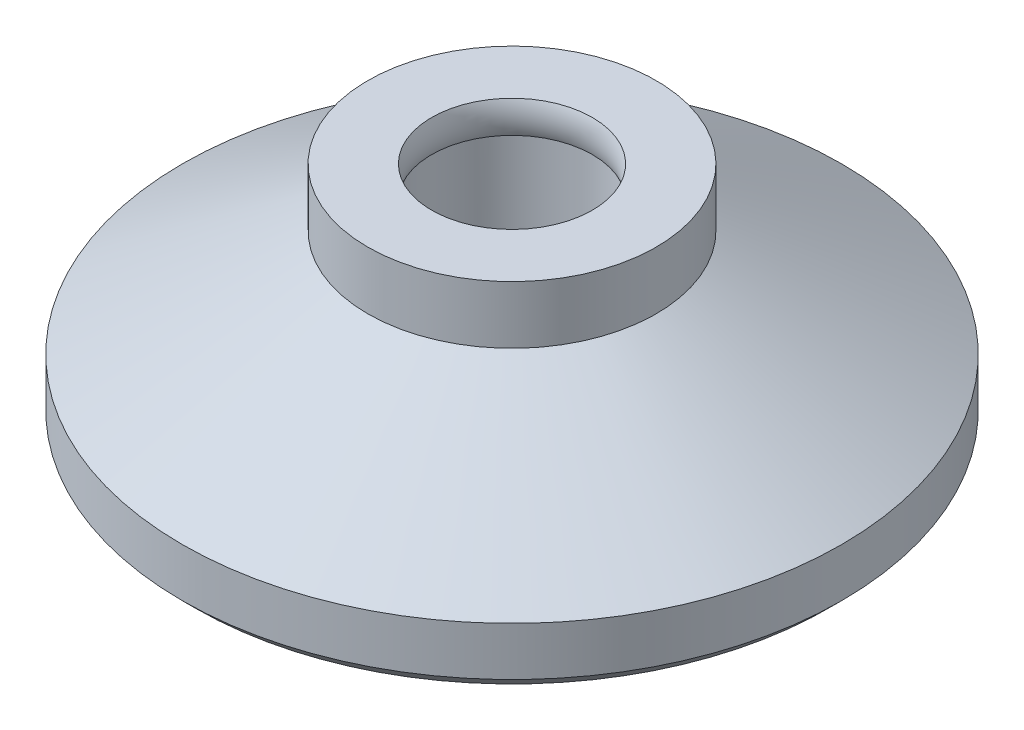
ISO-10303-21;
HEADER;
FILE_DESCRIPTION(('STEP AP214'),'2;1');
FILE_NAME('part.step','',(''),(''),'','','');
FILE_SCHEMA(('AUTOMOTIVE_DESIGN { 1 0 10303 214 1 1 1 1 }'));
ENDSEC;
DATA;
#1=APPLICATION_CONTEXT('core data for automotive mechanical design processes');
#2=APPLICATION_PROTOCOL_DEFINITION('international standard','automotive_design',2000,#1);
#3=PRODUCT_CONTEXT('',#1,'mechanical');
#4=PRODUCT('Part','Part','',(#3));
#5=PRODUCT_RELATED_PRODUCT_CATEGORY('part','',(#4));
#6=PRODUCT_DEFINITION_FORMATION('','',#4);
#7=PRODUCT_DEFINITION_CONTEXT('part definition',#1,'design');
#8=PRODUCT_DEFINITION('design','',#6,#7);
#9=PRODUCT_DEFINITION_SHAPE('','',#8);
#10=(LENGTH_UNIT() NAMED_UNIT(*) SI_UNIT(.MILLI.,.METRE.));
#11=(NAMED_UNIT(*) PLANE_ANGLE_UNIT() SI_UNIT($,.RADIAN.));
#12=(NAMED_UNIT(*) SI_UNIT($,.STERADIAN.) SOLID_ANGLE_UNIT());
#13=UNCERTAINTY_MEASURE_WITH_UNIT(LENGTH_MEASURE(1.E-05),#10,'distance_accuracy_value','');
#14=(GEOMETRIC_REPRESENTATION_CONTEXT(3) GLOBAL_UNCERTAINTY_ASSIGNED_CONTEXT((#13)) GLOBAL_UNIT_ASSIGNED_CONTEXT((#10,
#11,#12)) REPRESENTATION_CONTEXT('',''));
#15=CARTESIAN_POINT('',(0.,0.,0.));
#16=DIRECTION('',(0.,0.,1.));
#17=DIRECTION('',(1.,0.,0.));
#18=AXIS2_PLACEMENT_3D('',#15,#16,#17);
#19=CARTESIAN_POINT('',(0.,5.5,0.));
#20=DIRECTION('',(0.,-1.,0.));
#21=DIRECTION('',(0.,0.,-1.));
#22=AXIS2_PLACEMENT_3D('',#19,#20,#21);
#23=CYLINDRICAL_SURFACE('',#22,7.);
#24=CARTESIAN_POINT('',(0.,2.69615242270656,0.));
#25=DIRECTION('',(0.,1.,0.));
#26=DIRECTION('',(0.,0.,1.));
#27=AXIS2_PLACEMENT_3D('',#24,#25,#26);
#28=CIRCLE('',#27,7.);
#29=CARTESIAN_POINT('',(0.,2.69615242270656,7.));
#30=VERTEX_POINT('',#29);
#31=EDGE_CURVE('E91',#30,#30,#28,.T.);
#32=ORIENTED_EDGE('',*,*,#31,.T.);
#33=EDGE_LOOP('',(#32));
#34=FACE_BOUND('',#33,.T.);
#35=CARTESIAN_POINT('',(0.,5.5,0.));
#36=DIRECTION('',(0.,1.,0.));
#37=DIRECTION('',(0.,0.,1.));
#38=AXIS2_PLACEMENT_3D('',#35,#36,#37);
#39=CIRCLE('',#38,7.);
#40=CARTESIAN_POINT('',(0.,5.5,7.));
#41=VERTEX_POINT('',#40);
#42=EDGE_CURVE('E93',#41,#41,#39,.T.);
#43=ORIENTED_EDGE('',*,*,#42,.F.);
#44=EDGE_LOOP('',(#43));
#45=FACE_BOUND('',#44,.T.);
#46=ADVANCED_FACE('F37',(#34,#45),#23,.T.);
#47=CARTESIAN_POINT('',(0.,5.5,0.));
#48=DIRECTION('',(0.,1.,0.));
#49=DIRECTION('',(0.,0.,1.));
#50=AXIS2_PLACEMENT_3D('',#47,#48,#49);
#51=PLANE('',#50);
#52=CARTESIAN_POINT('',(0.,5.5,0.));
#53=DIRECTION('',(0.,-1.,0.));
#54=DIRECTION('',(0.,0.,-1.));
#55=AXIS2_PLACEMENT_3D('',#52,#53,#54);
#56=CIRCLE('',#55,3.9);
#57=CARTESIAN_POINT('',(0.,5.5,-3.9));
#58=VERTEX_POINT('',#57);
#59=EDGE_CURVE('E108',#58,#58,#56,.T.);
#60=ORIENTED_EDGE('',*,*,#59,.T.);
#61=EDGE_LOOP('',(#60));
#62=FACE_BOUND('',#61,.T.);
#63=ORIENTED_EDGE('',*,*,#42,.T.);
#64=EDGE_LOOP('',(#63));
#65=FACE_BOUND('',#64,.T.);
#66=ADVANCED_FACE('F65',(#62,#65),#51,.T.);
#67=CARTESIAN_POINT('',(0.,2.69615242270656,0.));
#68=DIRECTION('',(0.,-1.,0.));
#69=DIRECTION('',(0.,0.,-1.));
#70=AXIS2_PLACEMENT_3D('',#67,#68,#69);
#71=CONICAL_SURFACE('',#70,7.,1.0471975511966);
#72=CARTESIAN_POINT('',(0.,-2.5,0.));
#73=DIRECTION('',(0.,1.,0.));
#74=DIRECTION('',(0.,0.,1.));
#75=AXIS2_PLACEMENT_3D('',#72,#73,#74);
#76=CIRCLE('',#75,16.);
#77=CARTESIAN_POINT('',(0.,-2.5,16.));
#78=VERTEX_POINT('',#77);
#79=EDGE_CURVE('E89',#78,#78,#76,.T.);
#80=ORIENTED_EDGE('',*,*,#79,.T.);
#81=EDGE_LOOP('',(#80));
#82=FACE_BOUND('',#81,.T.);
#83=ORIENTED_EDGE('',*,*,#31,.F.);
#84=EDGE_LOOP('',(#83));
#85=FACE_BOUND('',#84,.T.);
#86=ADVANCED_FACE('F70',(#82,#85),#71,.T.);
#87=CARTESIAN_POINT('',(0.,-5.5,0.));
#88=DIRECTION('',(0.,1.,0.));
#89=DIRECTION('',(0.,0.,1.));
#90=AXIS2_PLACEMENT_3D('',#87,#88,#89);
#91=PLANE('',#90);
#92=CARTESIAN_POINT('',(0.,-5.5,0.));
#93=DIRECTION('',(0.,1.,0.));
#94=DIRECTION('',(0.,0.,1.));
#95=AXIS2_PLACEMENT_3D('',#92,#93,#94);
#96=CIRCLE('',#95,15.36);
#97=CARTESIAN_POINT('',(0.,-5.5,15.36));
#98=VERTEX_POINT('',#97);
#99=EDGE_CURVE('E45',#98,#98,#96,.F.);
#100=ORIENTED_EDGE('',*,*,#99,.T.);
#101=EDGE_LOOP('',(#100));
#102=FACE_BOUND('',#101,.T.);
#103=ADVANCED_FACE('F76',(#102),#91,.F.);
#104=CARTESIAN_POINT('',(0.,-2.5,0.));
#105=DIRECTION('',(0.,-1.,0.));
#106=DIRECTION('',(0.,0.,-1.));
#107=AXIS2_PLACEMENT_3D('',#104,#105,#106);
#108=CYLINDRICAL_SURFACE('',#107,16.);
#109=CARTESIAN_POINT('',(0.,-4.85999999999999,0.));
#110=DIRECTION('',(0.,1.,0.));
#111=DIRECTION('',(0.,0.,1.));
#112=AXIS2_PLACEMENT_3D('',#109,#110,#111);
#113=CIRCLE('',#112,16.);
#114=CARTESIAN_POINT('',(0.,-4.85999999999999,16.));
#115=VERTEX_POINT('',#114);
#116=EDGE_CURVE('E11',#115,#115,#113,.T.);
#117=ORIENTED_EDGE('',*,*,#116,.T.);
#118=EDGE_LOOP('',(#117));
#119=FACE_BOUND('',#118,.T.);
#120=ORIENTED_EDGE('',*,*,#79,.F.);
#121=EDGE_LOOP('',(#120));
#122=FACE_BOUND('',#121,.T.);
#123=ADVANCED_FACE('F60',(#119,#122),#108,.T.);
#124=CARTESIAN_POINT('',(0.,-5.5,0.));
#125=DIRECTION('',(0.,1.,0.));
#126=DIRECTION('',(0.,0.,1.));
#127=AXIS2_PLACEMENT_3D('',#124,#125,#126);
#128=CONICAL_SURFACE('',#127,15.36,0.785398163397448);
#129=CARTESIAN_POINT('',(0.,-4.85999999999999,16.));
#130=CARTESIAN_POINT('',(0.,-4.86666666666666,15.9933333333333));
#131=CARTESIAN_POINT('',(0.,-4.87333333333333,15.9866666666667));
#132=CARTESIAN_POINT('',(0.,-4.88666666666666,15.9733333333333));
#133=CARTESIAN_POINT('',(0.,-4.89333333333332,15.9666666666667));
#134=CARTESIAN_POINT('',(0.,-4.90666666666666,15.9533333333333));
#135=CARTESIAN_POINT('',(0.,-4.91333333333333,15.9466666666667));
#136=CARTESIAN_POINT('',(0.,-4.92666666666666,15.9333333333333));
#137=CARTESIAN_POINT('',(0.,-4.93333333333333,15.9266666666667));
#138=CARTESIAN_POINT('',(0.,-4.94666666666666,15.9133333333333));
#139=CARTESIAN_POINT('',(0.,-4.95333333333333,15.9066666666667));
#140=CARTESIAN_POINT('',(0.,-4.96666666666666,15.8933333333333));
#141=CARTESIAN_POINT('',(0.,-4.97333333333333,15.8866666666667));
#142=CARTESIAN_POINT('',(0.,-4.98666666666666,15.8733333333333));
#143=CARTESIAN_POINT('',(0.,-4.99333333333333,15.8666666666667));
#144=CARTESIAN_POINT('',(0.,-5.00666666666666,15.8533333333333));
#145=CARTESIAN_POINT('',(0.,-5.01333333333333,15.8466666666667));
#146=CARTESIAN_POINT('',(0.,-5.02666666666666,15.8333333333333));
#147=CARTESIAN_POINT('',(0.,-5.03333333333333,15.8266666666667));
#148=CARTESIAN_POINT('',(0.,-5.04666666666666,15.8133333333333));
#149=CARTESIAN_POINT('',(0.,-5.05333333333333,15.8066666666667));
#150=CARTESIAN_POINT('',(0.,-5.06666666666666,15.7933333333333));
#151=CARTESIAN_POINT('',(0.,-5.07333333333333,15.7866666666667));
#152=CARTESIAN_POINT('',(0.,-5.08666666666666,15.7733333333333));
#153=CARTESIAN_POINT('',(0.,-5.09333333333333,15.7666666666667));
#154=CARTESIAN_POINT('',(0.,-5.10666666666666,15.7533333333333));
#155=CARTESIAN_POINT('',(0.,-5.11333333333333,15.7466666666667));
#156=CARTESIAN_POINT('',(0.,-5.12666666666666,15.7333333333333));
#157=CARTESIAN_POINT('',(0.,-5.13333333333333,15.7266666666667));
#158=CARTESIAN_POINT('',(0.,-5.14666666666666,15.7133333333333));
#159=CARTESIAN_POINT('',(0.,-5.15333333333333,15.7066666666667));
#160=CARTESIAN_POINT('',(0.,-5.16666666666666,15.6933333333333));
#161=CARTESIAN_POINT('',(0.,-5.17333333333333,15.6866666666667));
#162=CARTESIAN_POINT('',(0.,-5.18666666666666,15.6733333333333));
#163=CARTESIAN_POINT('',(0.,-5.19333333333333,15.6666666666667));
#164=CARTESIAN_POINT('',(0.,-5.20666666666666,15.6533333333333));
#165=CARTESIAN_POINT('',(0.,-5.21333333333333,15.6466666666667));
#166=CARTESIAN_POINT('',(0.,-5.22666666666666,15.6333333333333));
#167=CARTESIAN_POINT('',(0.,-5.23333333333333,15.6266666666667));
#168=CARTESIAN_POINT('',(0.,-5.24666666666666,15.6133333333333));
#169=CARTESIAN_POINT('',(0.,-5.25333333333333,15.6066666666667));
#170=CARTESIAN_POINT('',(0.,-5.26666666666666,15.5933333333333));
#171=CARTESIAN_POINT('',(0.,-5.27333333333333,15.5866666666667));
#172=CARTESIAN_POINT('',(0.,-5.28666666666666,15.5733333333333));
#173=CARTESIAN_POINT('',(0.,-5.29333333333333,15.5666666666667));
#174=CARTESIAN_POINT('',(0.,-5.30666666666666,15.5533333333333));
#175=CARTESIAN_POINT('',(0.,-5.31333333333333,15.5466666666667));
#176=CARTESIAN_POINT('',(0.,-5.32666666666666,15.5333333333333));
#177=CARTESIAN_POINT('',(0.,-5.33333333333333,15.5266666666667));
#178=CARTESIAN_POINT('',(0.,-5.34666666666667,15.5133333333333));
#179=CARTESIAN_POINT('',(0.,-5.35333333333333,15.5066666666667));
#180=CARTESIAN_POINT('',(0.,-5.36666666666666,15.4933333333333));
#181=CARTESIAN_POINT('',(0.,-5.37333333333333,15.4866666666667));
#182=CARTESIAN_POINT('',(0.,-5.38666666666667,15.4733333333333));
#183=CARTESIAN_POINT('',(0.,-5.39333333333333,15.4666666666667));
#184=CARTESIAN_POINT('',(0.,-5.40666666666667,15.4533333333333));
#185=CARTESIAN_POINT('',(0.,-5.41333333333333,15.4466666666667));
#186=CARTESIAN_POINT('',(0.,-5.42666666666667,15.4333333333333));
#187=CARTESIAN_POINT('',(0.,-5.43333333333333,15.4266666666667));
#188=CARTESIAN_POINT('',(0.,-5.44666666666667,15.4133333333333));
#189=CARTESIAN_POINT('',(0.,-5.45333333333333,15.4066666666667));
#190=CARTESIAN_POINT('',(0.,-5.46666666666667,15.3933333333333));
#191=CARTESIAN_POINT('',(0.,-5.47333333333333,15.3866666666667));
#192=CARTESIAN_POINT('',(0.,-5.48666666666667,15.3733333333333));
#193=CARTESIAN_POINT('',(0.,-5.49333333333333,15.3666666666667));
#194=CARTESIAN_POINT('',(0.,-5.5,15.36));
#195=B_SPLINE_CURVE_WITH_KNOTS('',3,(#129,#130,#131,#132,#133,#134,#135,#136,#137,#138,#139,
#140,#141,#142,#143,#144,#145,#146,#147,#148,#149,#150,#151,#152,#153,#154,#155,#156,#157,#158,
#159,#160,#161,#162,#163,#164,#165,#166,#167,#168,#169,#170,#171,#172,#173,#174,#175,#176,#177,
#178,#179,#180,#181,#182,#183,#184,#185,#186,#187,#188,#189,#190,#191,#192,#193,#194),
.UNSPECIFIED.,.F.,.F.,(4,2,2,2,2,2,2,2,2,2,2,2,2,2,2,2,2,2,2,2,2,2,2,2,2,2,2,2,2,2,2,2,4),(0.,
0.0282842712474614,0.0565685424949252,0.0848528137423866,0.113137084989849,0.141421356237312,
0.169705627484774,0.197989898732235,0.2262741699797,0.254558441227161,0.282842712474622,
0.311126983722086,0.339411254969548,0.367695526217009,0.395979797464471,0.424264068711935,
0.452548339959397,0.480832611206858,0.509116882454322,0.537401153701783,0.565685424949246,
0.593969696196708,0.62225396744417,0.650538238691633,0.678822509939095,0.707106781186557,
0.735391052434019,0.763675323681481,0.791959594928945,0.820243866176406,0.848528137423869,
0.876812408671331,0.905096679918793),.UNSPECIFIED.);
#196=EDGE_CURVE('BSEAM39',#115,#98,#195,.T.);
#197=ORIENTED_EDGE('',*,*,#116,.F.);
#198=ORIENTED_EDGE('',*,*,#99,.F.);
#199=ORIENTED_EDGE('',*,*,#196,.T.);
#200=ORIENTED_EDGE('',*,*,#196,.F.);
#201=EDGE_LOOP('',(#197,#199,#198,#200));
#202=FACE_BOUND('',#201,.T.);
#203=ADVANCED_FACE('F39',(#202),#128,.T.);
#204=CARTESIAN_POINT('',(0.,-2.5,0.));
#205=DIRECTION('',(0.,1.,0.));
#206=DIRECTION('',(0.,0.,1.));
#207=AXIS2_PLACEMENT_3D('',#204,#205,#206);
#208=CONICAL_SURFACE('',#207,0.,1.04719755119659);
#209=CARTESIAN_POINT('',(0.,-0.248333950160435,0.));
#210=DIRECTION('',(0.,-1.,0.));
#211=DIRECTION('',(0.,0.,-1.));
#212=AXIS2_PLACEMENT_3D('',#209,#210,#211);
#213=CIRCLE('',#212,3.9);
#214=CARTESIAN_POINT('',(0.,-0.248333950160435,-3.9));
#215=VERTEX_POINT('',#214);
#216=EDGE_CURVE('E100',#215,#215,#213,.T.);
#217=ORIENTED_EDGE('',*,*,#216,.F.);
#218=EDGE_LOOP('',(#217));
#219=FACE_BOUND('',#218,.T.);
#220=CARTESIAN_POINT('',(0.,-2.5,0.));
#221=VERTEX_POINT('',#220);
#222=VERTEX_LOOP('',#221);
#223=FACE_BOUND('',#222,.T.);
#224=ADVANCED_FACE('F48',(#219,#223),#208,.F.);
#225=CARTESIAN_POINT('',(0.,0.,0.));
#226=DIRECTION('',(0.,-1.,0.));
#227=DIRECTION('',(0.,0.,-1.));
#228=AXIS2_PLACEMENT_3D('',#225,#226,#227);
#229=CYLINDRICAL_SURFACE('',#228,3.9);
#230=CARTESIAN_POINT('',(0.,3.94,0.));
#231=DIRECTION('',(0.,-1.,0.));
#232=DIRECTION('',(0.,0.,-1.));
#233=AXIS2_PLACEMENT_3D('',#230,#231,#232);
#234=CIRCLE('',#233,3.9);
#235=CARTESIAN_POINT('',(0.,3.94,-3.9));
#236=VERTEX_POINT('',#235);
#237=EDGE_CURVE('E111',#236,#236,#234,.T.);
#238=ORIENTED_EDGE('',*,*,#237,.F.);
#239=EDGE_LOOP('',(#238));
#240=FACE_BOUND('',#239,.T.);
#241=ORIENTED_EDGE('',*,*,#216,.T.);
#242=EDGE_LOOP('',(#241));
#243=FACE_BOUND('',#242,.T.);
#244=ADVANCED_FACE('F50',(#240,#243),#229,.F.);
#245=CARTESIAN_POINT('',(0.,4.72,0.));
#246=DIRECTION('',(0.,-1.,0.));
#247=DIRECTION('',(0.,0.,-1.));
#248=AXIS2_PLACEMENT_3D('',#245,#246,#247);
#249=TOROIDAL_SURFACE('',#248,5.77200000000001,2.02800000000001);
#250=ORIENTED_EDGE('',*,*,#59,.F.);
#251=EDGE_LOOP('',(#250));
#252=FACE_BOUND('',#251,.T.);
#253=ORIENTED_EDGE('',*,*,#237,.T.);
#254=EDGE_LOOP('',(#253));
#255=FACE_BOUND('',#254,.T.);
#256=ADVANCED_FACE('F57',(#252,#255),#249,.T.);
#257=CLOSED_SHELL('',(#46,#66,#86,#103,#123,#203,#224,#244,#256));
#258=MANIFOLD_SOLID_BREP('B2',#257);
#259=ADVANCED_BREP_SHAPE_REPRESENTATION('',(#18,#258),#14);
#260=SHAPE_DEFINITION_REPRESENTATION(#9,#259);
ENDSEC;
END-ISO-10303-21;
